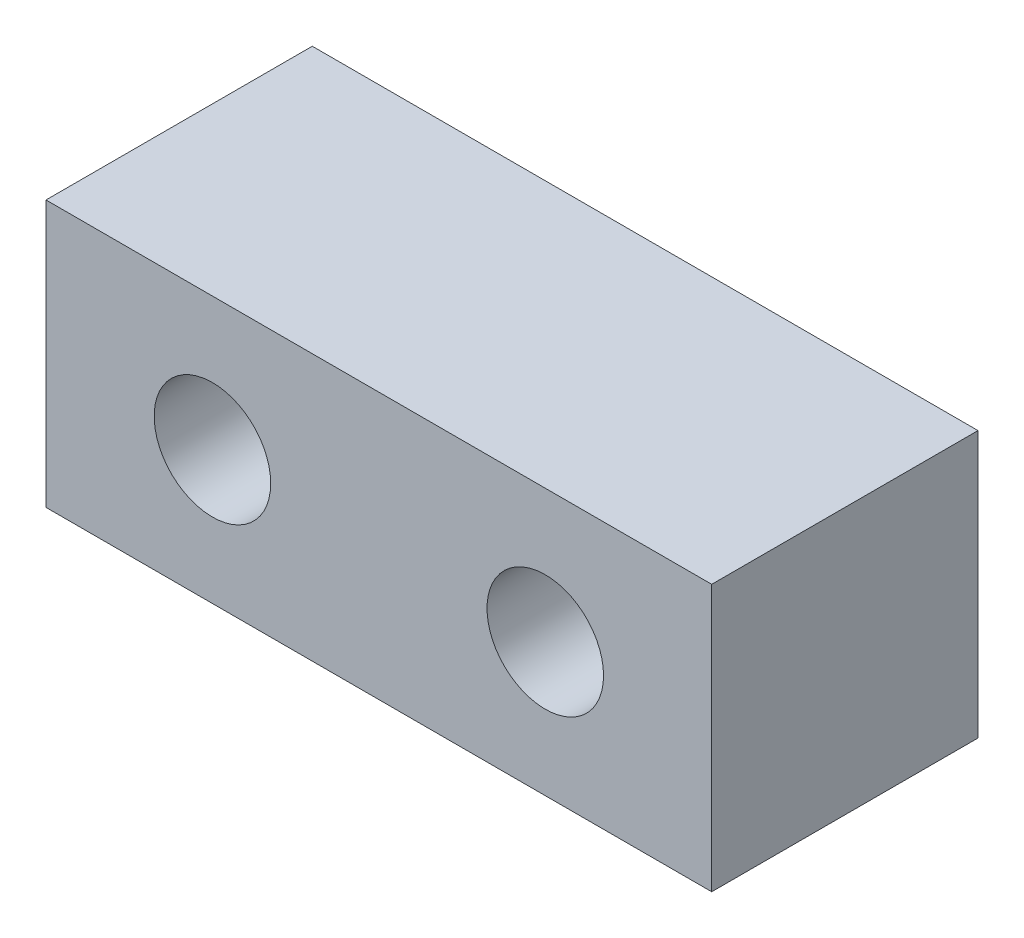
ISO-10303-21;
HEADER;
FILE_DESCRIPTION(('STEP AP214'),'2;1');
FILE_NAME('part.step','',(''),(''),'','','');
FILE_SCHEMA(('AUTOMOTIVE_DESIGN { 1 0 10303 214 1 1 1 1 }'));
ENDSEC;
DATA;
#1=APPLICATION_CONTEXT('core data for automotive mechanical design processes');
#2=APPLICATION_PROTOCOL_DEFINITION('international standard','automotive_design',2000,#1);
#3=PRODUCT_CONTEXT('',#1,'mechanical');
#4=PRODUCT('Part','Part','',(#3));
#5=PRODUCT_RELATED_PRODUCT_CATEGORY('part','',(#4));
#6=PRODUCT_DEFINITION_FORMATION('','',#4);
#7=PRODUCT_DEFINITION_CONTEXT('part definition',#1,'design');
#8=PRODUCT_DEFINITION('design','',#6,#7);
#9=PRODUCT_DEFINITION_SHAPE('','',#8);
#10=(LENGTH_UNIT() NAMED_UNIT(*) SI_UNIT(.MILLI.,.METRE.));
#11=(NAMED_UNIT(*) PLANE_ANGLE_UNIT() SI_UNIT($,.RADIAN.));
#12=(NAMED_UNIT(*) SI_UNIT($,.STERADIAN.) SOLID_ANGLE_UNIT());
#13=UNCERTAINTY_MEASURE_WITH_UNIT(LENGTH_MEASURE(1.E-05),#10,'distance_accuracy_value','');
#14=(GEOMETRIC_REPRESENTATION_CONTEXT(3) GLOBAL_UNCERTAINTY_ASSIGNED_CONTEXT((#13)) GLOBAL_UNIT_ASSIGNED_CONTEXT((#10,
#11,#12)) REPRESENTATION_CONTEXT('',''));
#15=CARTESIAN_POINT('',(0.,0.,0.));
#16=DIRECTION('',(0.,0.,1.));
#17=DIRECTION('',(1.,0.,0.));
#18=AXIS2_PLACEMENT_3D('',#15,#16,#17);
#19=CARTESIAN_POINT('',(-15.875,6.35,12.7));
#20=DIRECTION('',(1.,0.,0.));
#21=DIRECTION('',(0.,0.,-1.));
#22=AXIS2_PLACEMENT_3D('',#19,#20,#21);
#23=PLANE('',#22);
#24=DIRECTION('',(0.,-1.,0.));
#25=VECTOR('',#24,1.);
#26=CARTESIAN_POINT('',(-15.875,6.35,0.));
#27=LINE('',#26,#25);
#28=CARTESIAN_POINT('',(-15.875,6.35,0.));
#29=VERTEX_POINT('',#28);
#30=CARTESIAN_POINT('',(-15.875,-6.35,0.));
#31=VERTEX_POINT('',#30);
#32=EDGE_CURVE('E96',#29,#31,#27,.T.);
#33=ORIENTED_EDGE('',*,*,#32,.T.);
#34=DIRECTION('',(0.,0.,-1.));
#35=VECTOR('',#34,1.);
#36=CARTESIAN_POINT('',(-15.875,-6.35,12.7));
#37=LINE('',#36,#35);
#38=CARTESIAN_POINT('',(-15.875,-6.35,12.7));
#39=VERTEX_POINT('',#38);
#40=EDGE_CURVE('E11',#39,#31,#37,.T.);
#41=ORIENTED_EDGE('',*,*,#40,.F.);
#42=DIRECTION('',(0.,-1.,0.));
#43=VECTOR('',#42,1.);
#44=CARTESIAN_POINT('',(-15.875,6.35,12.7));
#45=LINE('',#44,#43);
#46=CARTESIAN_POINT('',(-15.875,6.35,12.7));
#47=VERTEX_POINT('',#46);
#48=EDGE_CURVE('E84',#47,#39,#45,.T.);
#49=ORIENTED_EDGE('',*,*,#48,.F.);
#50=DIRECTION('',(0.,0.,-1.));
#51=VECTOR('',#50,1.);
#52=CARTESIAN_POINT('',(-15.875,6.35,12.7));
#53=LINE('',#52,#51);
#54=EDGE_CURVE('E92',#47,#29,#53,.T.);
#55=ORIENTED_EDGE('',*,*,#54,.T.);
#56=EDGE_LOOP('',(#33,#41,#49,#55));
#57=FACE_BOUND('',#56,.T.);
#58=ADVANCED_FACE('F33',(#57),#23,.F.);
#59=CARTESIAN_POINT('',(-15.875,-6.35,12.7));
#60=DIRECTION('',(0.,1.,0.));
#61=DIRECTION('',(0.,0.,1.));
#62=AXIS2_PLACEMENT_3D('',#59,#60,#61);
#63=PLANE('',#62);
#64=DIRECTION('',(1.,0.,0.));
#65=VECTOR('',#64,1.);
#66=CARTESIAN_POINT('',(-15.875,-6.35,0.));
#67=LINE('',#66,#65);
#68=CARTESIAN_POINT('',(15.875,-6.35,0.));
#69=VERTEX_POINT('',#68);
#70=EDGE_CURVE('E88',#31,#69,#67,.T.);
#71=ORIENTED_EDGE('',*,*,#70,.T.);
#72=DIRECTION('',(0.,0.,-1.));
#73=VECTOR('',#72,1.);
#74=CARTESIAN_POINT('',(15.875,-6.35,12.7));
#75=LINE('',#74,#73);
#76=CARTESIAN_POINT('',(15.875,-6.35,12.7));
#77=VERTEX_POINT('',#76);
#78=EDGE_CURVE('E41',#77,#69,#75,.T.);
#79=ORIENTED_EDGE('',*,*,#78,.F.);
#80=DIRECTION('',(1.,0.,0.));
#81=VECTOR('',#80,1.);
#82=CARTESIAN_POINT('',(-15.875,-6.35,12.7));
#83=LINE('',#82,#81);
#84=EDGE_CURVE('E79',#39,#77,#83,.T.);
#85=ORIENTED_EDGE('',*,*,#84,.F.);
#86=ORIENTED_EDGE('',*,*,#40,.T.);
#87=EDGE_LOOP('',(#71,#79,#85,#86));
#88=FACE_BOUND('',#87,.T.);
#89=ADVANCED_FACE('F87',(#88),#63,.F.);
#90=CARTESIAN_POINT('',(15.875,-6.35,12.7));
#91=DIRECTION('',(-1.,0.,0.));
#92=DIRECTION('',(0.,0.,1.));
#93=AXIS2_PLACEMENT_3D('',#90,#91,#92);
#94=PLANE('',#93);
#95=DIRECTION('',(0.,1.,0.));
#96=VECTOR('',#95,1.);
#97=CARTESIAN_POINT('',(15.875,-6.35,0.));
#98=LINE('',#97,#96);
#99=CARTESIAN_POINT('',(15.875,6.35,0.));
#100=VERTEX_POINT('',#99);
#101=EDGE_CURVE('E66',#69,#100,#98,.T.);
#102=ORIENTED_EDGE('',*,*,#101,.T.);
#103=DIRECTION('',(0.,0.,-1.));
#104=VECTOR('',#103,1.);
#105=CARTESIAN_POINT('',(15.875,6.35,12.7));
#106=LINE('',#105,#104);
#107=CARTESIAN_POINT('',(15.875,6.35,12.7));
#108=VERTEX_POINT('',#107);
#109=EDGE_CURVE('E89',#108,#100,#106,.T.);
#110=ORIENTED_EDGE('',*,*,#109,.F.);
#111=DIRECTION('',(0.,1.,0.));
#112=VECTOR('',#111,1.);
#113=CARTESIAN_POINT('',(15.875,-6.35,12.7));
#114=LINE('',#113,#112);
#115=EDGE_CURVE('E82',#77,#108,#114,.T.);
#116=ORIENTED_EDGE('',*,*,#115,.F.);
#117=ORIENTED_EDGE('',*,*,#78,.T.);
#118=EDGE_LOOP('',(#102,#110,#116,#117));
#119=FACE_BOUND('',#118,.T.);
#120=ADVANCED_FACE('F90',(#119),#94,.F.);
#121=CARTESIAN_POINT('',(15.875,6.35,12.7));
#122=DIRECTION('',(0.,-1.,0.));
#123=DIRECTION('',(0.,0.,-1.));
#124=AXIS2_PLACEMENT_3D('',#121,#122,#123);
#125=PLANE('',#124);
#126=DIRECTION('',(-1.,0.,0.));
#127=VECTOR('',#126,1.);
#128=CARTESIAN_POINT('',(15.875,6.35,0.));
#129=LINE('',#128,#127);
#130=EDGE_CURVE('E72',#100,#29,#129,.T.);
#131=ORIENTED_EDGE('',*,*,#130,.T.);
#132=ORIENTED_EDGE('',*,*,#54,.F.);
#133=DIRECTION('',(-1.,0.,0.));
#134=VECTOR('',#133,1.);
#135=CARTESIAN_POINT('',(15.875,6.35,12.7));
#136=LINE('',#135,#134);
#137=EDGE_CURVE('E49',#108,#47,#136,.T.);
#138=ORIENTED_EDGE('',*,*,#137,.F.);
#139=ORIENTED_EDGE('',*,*,#109,.T.);
#140=EDGE_LOOP('',(#131,#132,#138,#139));
#141=FACE_BOUND('',#140,.T.);
#142=ADVANCED_FACE('F104',(#141),#125,.F.);
#143=CARTESIAN_POINT('',(0.,0.,12.7));
#144=DIRECTION('',(0.,0.,1.));
#145=DIRECTION('',(1.,0.,0.));
#146=AXIS2_PLACEMENT_3D('',#143,#144,#145);
#147=PLANE('',#146);
#148=CARTESIAN_POINT('',(-7.9375,0.,12.7));
#149=DIRECTION('',(0.,0.,1.));
#150=DIRECTION('',(1.,0.,0.));
#151=AXIS2_PLACEMENT_3D('',#148,#149,#150);
#152=CIRCLE('',#151,2.77876);
#153=CARTESIAN_POINT('',(-5.15874,0.,12.7));
#154=VERTEX_POINT('',#153);
#155=EDGE_CURVE('E130',#154,#154,#152,.T.);
#156=ORIENTED_EDGE('',*,*,#155,.F.);
#157=EDGE_LOOP('',(#156));
#158=FACE_BOUND('',#157,.T.);
#159=CARTESIAN_POINT('',(7.9375,0.,12.7));
#160=DIRECTION('',(0.,0.,1.));
#161=DIRECTION('',(1.,0.,0.));
#162=AXIS2_PLACEMENT_3D('',#159,#160,#161);
#163=CIRCLE('',#162,2.77876);
#164=CARTESIAN_POINT('',(10.71626,0.,12.7));
#165=VERTEX_POINT('',#164);
#166=EDGE_CURVE('E118',#165,#165,#163,.T.);
#167=ORIENTED_EDGE('',*,*,#166,.F.);
#168=EDGE_LOOP('',(#167));
#169=FACE_BOUND('',#168,.T.);
#170=ORIENTED_EDGE('',*,*,#48,.T.);
#171=ORIENTED_EDGE('',*,*,#84,.T.);
#172=ORIENTED_EDGE('',*,*,#115,.T.);
#173=ORIENTED_EDGE('',*,*,#137,.T.);
#174=EDGE_LOOP('',(#170,#171,#172,#173));
#175=FACE_BOUND('',#174,.T.);
#176=ADVANCED_FACE('F80',(#158,#169,#175),#147,.T.);
#177=CARTESIAN_POINT('',(0.,0.,0.));
#178=DIRECTION('',(0.,0.,1.));
#179=DIRECTION('',(1.,0.,0.));
#180=AXIS2_PLACEMENT_3D('',#177,#178,#179);
#181=PLANE('',#180);
#182=CARTESIAN_POINT('',(-7.9375,0.,0.));
#183=DIRECTION('',(0.,0.,1.));
#184=DIRECTION('',(1.,0.,0.));
#185=AXIS2_PLACEMENT_3D('',#182,#183,#184);
#186=CIRCLE('',#185,1.4732);
#187=CARTESIAN_POINT('',(-6.4643,0.,0.));
#188=VERTEX_POINT('',#187);
#189=EDGE_CURVE('E121',#188,#188,#186,.T.);
#190=ORIENTED_EDGE('',*,*,#189,.T.);
#191=EDGE_LOOP('',(#190));
#192=FACE_BOUND('',#191,.T.);
#193=CARTESIAN_POINT('',(7.9375,0.,0.));
#194=DIRECTION('',(0.,0.,1.));
#195=DIRECTION('',(1.,0.,0.));
#196=AXIS2_PLACEMENT_3D('',#193,#194,#195);
#197=CIRCLE('',#196,1.4732);
#198=CARTESIAN_POINT('',(9.4107,0.,0.));
#199=VERTEX_POINT('',#198);
#200=EDGE_CURVE('E99',#199,#199,#197,.T.);
#201=ORIENTED_EDGE('',*,*,#200,.T.);
#202=EDGE_LOOP('',(#201));
#203=FACE_BOUND('',#202,.T.);
#204=ORIENTED_EDGE('',*,*,#32,.F.);
#205=ORIENTED_EDGE('',*,*,#130,.F.);
#206=ORIENTED_EDGE('',*,*,#101,.F.);
#207=ORIENTED_EDGE('',*,*,#70,.F.);
#208=EDGE_LOOP('',(#204,#205,#206,#207));
#209=FACE_BOUND('',#208,.T.);
#210=ADVANCED_FACE('F107',(#192,#203,#209),#181,.F.);
#211=CARTESIAN_POINT('',(7.9375,0.,12.7));
#212=DIRECTION('',(0.,0.,1.));
#213=DIRECTION('',(1.,0.,0.));
#214=AXIS2_PLACEMENT_3D('',#211,#212,#213);
#215=CYLINDRICAL_SURFACE('',#214,1.4732);
#216=ORIENTED_EDGE('',*,*,#200,.F.);
#217=EDGE_LOOP('',(#216));
#218=FACE_BOUND('',#217,.T.);
#219=CARTESIAN_POINT('',(7.9375,0.,6.35));
#220=DIRECTION('',(0.,0.,1.));
#221=DIRECTION('',(1.,0.,0.));
#222=AXIS2_PLACEMENT_3D('',#219,#220,#221);
#223=CIRCLE('',#222,1.4732);
#224=CARTESIAN_POINT('',(9.4107,0.,6.35));
#225=VERTEX_POINT('',#224);
#226=EDGE_CURVE('E112',#225,#225,#223,.T.);
#227=ORIENTED_EDGE('',*,*,#226,.T.);
#228=EDGE_LOOP('',(#227));
#229=FACE_BOUND('',#228,.T.);
#230=ADVANCED_FACE('F154',(#218,#229),#215,.F.);
#231=CARTESIAN_POINT('',(9.4107,0.,6.35));
#232=DIRECTION('',(0.,0.,-1.));
#233=DIRECTION('',(-1.,0.,0.));
#234=AXIS2_PLACEMENT_3D('',#231,#232,#233);
#235=PLANE('',#234);
#236=ORIENTED_EDGE('',*,*,#226,.F.);
#237=EDGE_LOOP('',(#236));
#238=FACE_BOUND('',#237,.T.);
#239=CARTESIAN_POINT('',(7.9375,0.,6.35));
#240=DIRECTION('',(0.,0.,1.));
#241=DIRECTION('',(1.,0.,0.));
#242=AXIS2_PLACEMENT_3D('',#239,#240,#241);
#243=CIRCLE('',#242,2.77876);
#244=CARTESIAN_POINT('',(10.71626,0.,6.35));
#245=VERTEX_POINT('',#244);
#246=EDGE_CURVE('E115',#245,#245,#243,.T.);
#247=ORIENTED_EDGE('',*,*,#246,.T.);
#248=EDGE_LOOP('',(#247));
#249=FACE_BOUND('',#248,.T.);
#250=ADVANCED_FACE('F144',(#238,#249),#235,.F.);
#251=CARTESIAN_POINT('',(7.9375,0.,12.7));
#252=DIRECTION('',(0.,0.,1.));
#253=DIRECTION('',(1.,0.,0.));
#254=AXIS2_PLACEMENT_3D('',#251,#252,#253);
#255=CYLINDRICAL_SURFACE('',#254,2.77876);
#256=ORIENTED_EDGE('',*,*,#246,.F.);
#257=EDGE_LOOP('',(#256));
#258=FACE_BOUND('',#257,.T.);
#259=ORIENTED_EDGE('',*,*,#166,.T.);
#260=EDGE_LOOP('',(#259));
#261=FACE_BOUND('',#260,.T.);
#262=ADVANCED_FACE('F141',(#258,#261),#255,.F.);
#263=CARTESIAN_POINT('',(-7.9375,0.,12.7));
#264=DIRECTION('',(0.,0.,1.));
#265=DIRECTION('',(1.,0.,0.));
#266=AXIS2_PLACEMENT_3D('',#263,#264,#265);
#267=CYLINDRICAL_SURFACE('',#266,1.4732);
#268=ORIENTED_EDGE('',*,*,#189,.F.);
#269=EDGE_LOOP('',(#268));
#270=FACE_BOUND('',#269,.T.);
#271=CARTESIAN_POINT('',(-7.9375,0.,6.35));
#272=DIRECTION('',(0.,0.,1.));
#273=DIRECTION('',(1.,0.,0.));
#274=AXIS2_PLACEMENT_3D('',#271,#272,#273);
#275=CIRCLE('',#274,1.4732);
#276=CARTESIAN_POINT('',(-6.4643,0.,6.35));
#277=VERTEX_POINT('',#276);
#278=EDGE_CURVE('E124',#277,#277,#275,.T.);
#279=ORIENTED_EDGE('',*,*,#278,.T.);
#280=EDGE_LOOP('',(#279));
#281=FACE_BOUND('',#280,.T.);
#282=ADVANCED_FACE('F143',(#270,#281),#267,.F.);
#283=CARTESIAN_POINT('',(-6.4643,0.,6.35));
#284=DIRECTION('',(0.,0.,-1.));
#285=DIRECTION('',(-1.,0.,0.));
#286=AXIS2_PLACEMENT_3D('',#283,#284,#285);
#287=PLANE('',#286);
#288=ORIENTED_EDGE('',*,*,#278,.F.);
#289=EDGE_LOOP('',(#288));
#290=FACE_BOUND('',#289,.T.);
#291=CARTESIAN_POINT('',(-7.9375,0.,6.35));
#292=DIRECTION('',(0.,0.,1.));
#293=DIRECTION('',(1.,0.,0.));
#294=AXIS2_PLACEMENT_3D('',#291,#292,#293);
#295=CIRCLE('',#294,2.77876);
#296=CARTESIAN_POINT('',(-5.15874,0.,6.35));
#297=VERTEX_POINT('',#296);
#298=EDGE_CURVE('E127',#297,#297,#295,.T.);
#299=ORIENTED_EDGE('',*,*,#298,.T.);
#300=EDGE_LOOP('',(#299));
#301=FACE_BOUND('',#300,.T.);
#302=ADVANCED_FACE('F151',(#290,#301),#287,.F.);
#303=CARTESIAN_POINT('',(-7.9375,0.,12.7));
#304=DIRECTION('',(0.,0.,1.));
#305=DIRECTION('',(1.,0.,0.));
#306=AXIS2_PLACEMENT_3D('',#303,#304,#305);
#307=CYLINDRICAL_SURFACE('',#306,2.77876);
#308=ORIENTED_EDGE('',*,*,#298,.F.);
#309=EDGE_LOOP('',(#308));
#310=FACE_BOUND('',#309,.T.);
#311=ORIENTED_EDGE('',*,*,#155,.T.);
#312=EDGE_LOOP('',(#311));
#313=FACE_BOUND('',#312,.T.);
#314=ADVANCED_FACE('F134',(#310,#313),#307,.F.);
#315=CLOSED_SHELL('',(#58,#89,#120,#142,#176,#210,#230,#250,#262,#282,#302,#314));
#316=MANIFOLD_SOLID_BREP('B2',#315);
#317=ADVANCED_BREP_SHAPE_REPRESENTATION('',(#18,#316),#14);
#318=SHAPE_DEFINITION_REPRESENTATION(#9,#317);
ENDSEC;
END-ISO-10303-21;
